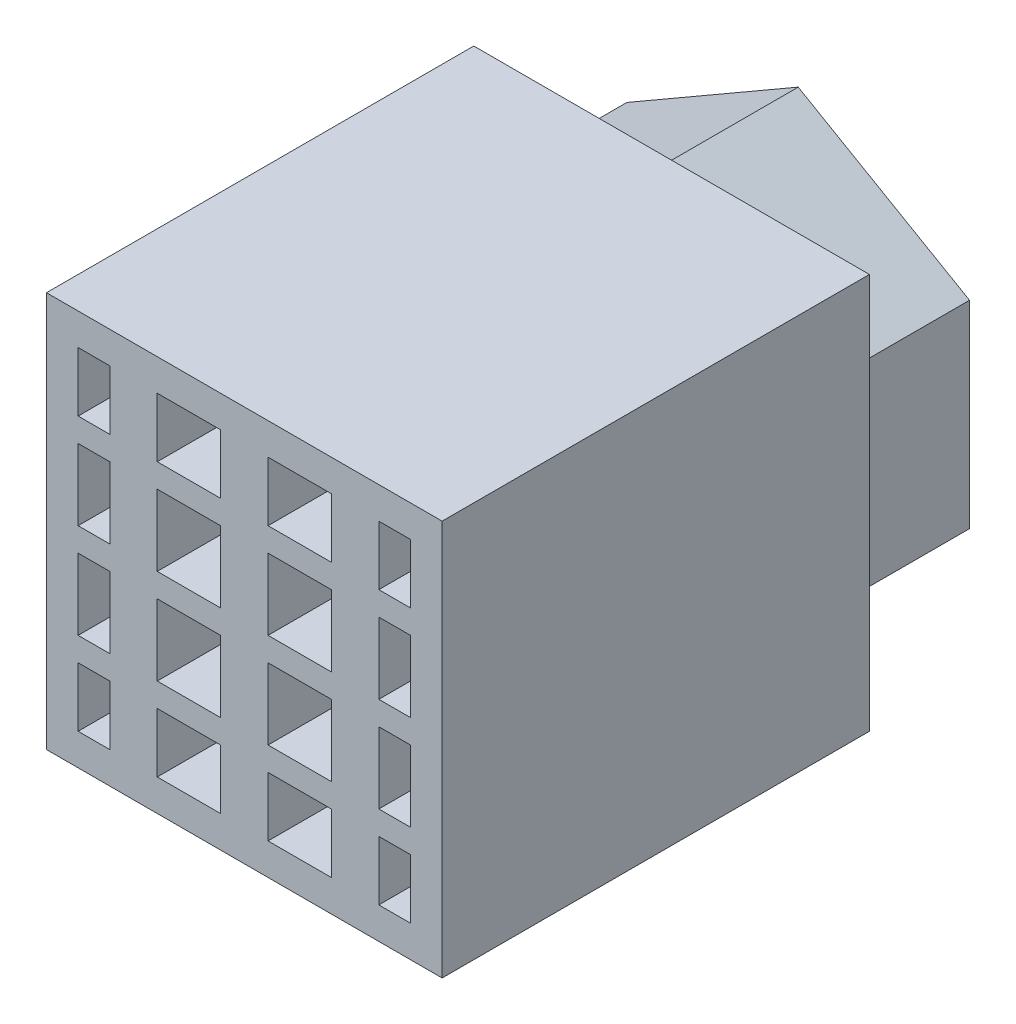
from build123d import *

# Parameters (mm, degrees)
SKETCH_8_W       = 25
SKETCH_8_H       = 25
SKETCH_8_W_2     = 4
SKETCH_8_H_2     = 21
SKETCH_8_W_3     = 2
EXTRUDE_7_DEPTH  = 25
SKETCH_9_W       = 25
SKETCH_9_H       = 25
EXTRUDE_8_DEPTH  = 2
SKETCH_14_W      = 25
SKETCH_14_H      = 1.5
EXTRUDE_11_DEPTH = 25
EXTRUDE_14_DEPTH = 6
EXTRUDE_16_DEPTH = 2


with BuildPart() as part:
    # Sketch 8 → Extrude 7 (new body)
    with BuildSketch(Plane.XY):
        Rectangle(SKETCH_8_W, SKETCH_8_H)
        with Locations((3.5, 0)):
            Rectangle(SKETCH_8_W_2, SKETCH_8_H_2, mode=Mode.SUBTRACT)
        with Locations((-3.5, 0)):
            Rectangle(SKETCH_8_W_2, SKETCH_8_H_2, mode=Mode.SUBTRACT)
        with Locations((-9.5, 0)):
            Rectangle(SKETCH_8_W_3, SKETCH_8_H_2, mode=Mode.SUBTRACT)
        with Locations((9.5, 0)):
            Rectangle(SKETCH_8_W_3, SKETCH_8_H_2, mode=Mode.SUBTRACT)
    extrude(amount=EXTRUDE_7_DEPTH)

    # Sketch 9 → Extrude 8 (add)
    with BuildSketch(Plane(origin=(0, 0, 0), x_dir=(-1, 0, 0), z_dir=(0, 0, -1))):
        Rectangle(SKETCH_9_W, SKETCH_9_H)
    extrude(amount=EXTRUDE_8_DEPTH)

    # Sketch 14 → Extrude 11 (add)
    with BuildSketch(Plane.XY.offset(25)):
        Rectangle(SKETCH_14_W, SKETCH_14_H)
        with Locations((0, 6)):
            Rectangle(SKETCH_14_W, SKETCH_14_H)
        with Locations((0, -6)):
            Rectangle(SKETCH_14_W, SKETCH_14_H)
    extrude(amount=-EXTRUDE_11_DEPTH)

    # Sketch 16 → Extrude 14 (add)
    with BuildSketch(Plane(origin=(0, 0, -2), x_dir=(-1, 0, 0), z_dir=(0, 0, -1))):
        Polygon((0, -12.5), (10.825317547, -6.25), (10.825317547, 6.25), (0, 12.5), (-10.825317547, 6.25), (-10.825317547, -6.25), align=None)
        Polygon((0, -10.190598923), (8.825317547, -5.095299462), (8.825317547, 5.095299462), (0, 10.190598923), (-8.825317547, 5.095299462), (-8.825317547, -5.095299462), align=None, mode=Mode.SUBTRACT)
    extrude(amount=EXTRUDE_14_DEPTH)

    # Sketch 18 → Extrude 16 (add)
    with BuildSketch(Plane(origin=(0, 0, -8), x_dir=(-1, 0, 0), z_dir=(0, 0, -1))):
        Polygon((0, 12.5), (-10.825317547, 6.25), (-10.825317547, -6.25), (0, -12.5), (10.825317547, -6.25), (10.825317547, 6.25), align=None)
    extrude(amount=EXTRUDE_16_DEPTH)


solid = part.part
